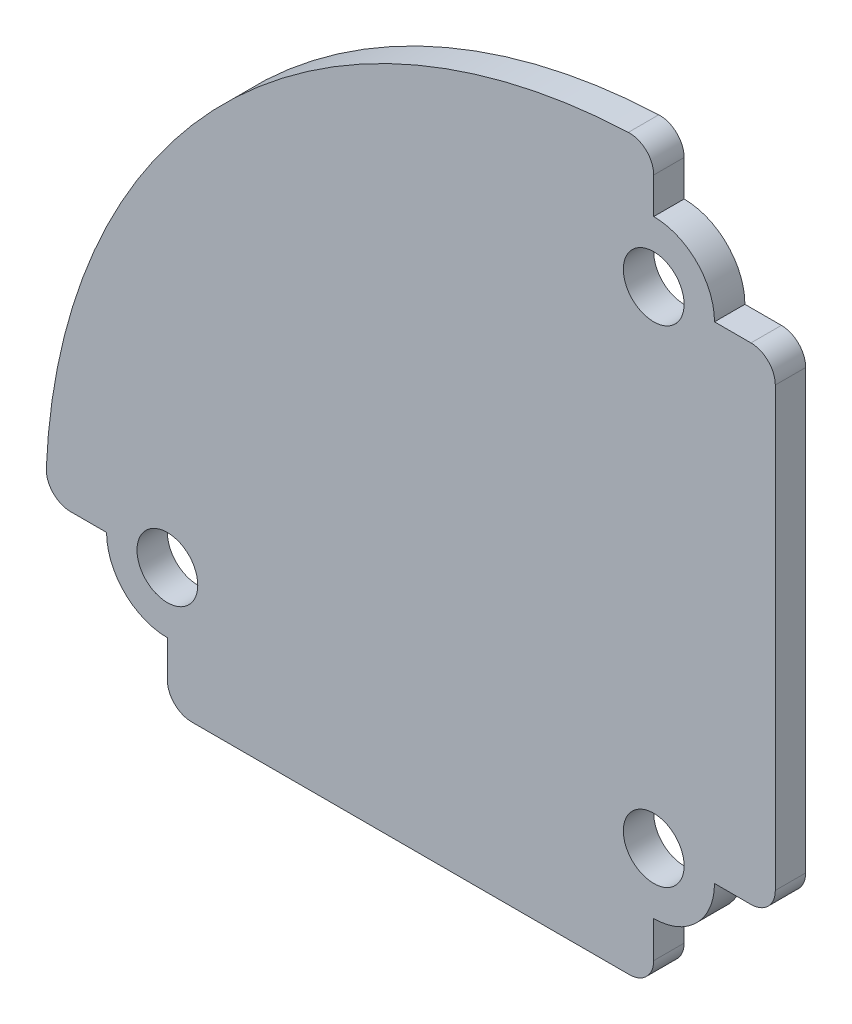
ISO-10303-21;
HEADER;
FILE_DESCRIPTION(('STEP AP214'),'2;1');
FILE_NAME('part.step','',(''),(''),'','','');
FILE_SCHEMA(('AUTOMOTIVE_DESIGN { 1 0 10303 214 1 1 1 1 }'));
ENDSEC;
DATA;
#1=APPLICATION_CONTEXT('core data for automotive mechanical design processes');
#2=APPLICATION_PROTOCOL_DEFINITION('international standard','automotive_design',2000,#1);
#3=PRODUCT_CONTEXT('',#1,'mechanical');
#4=PRODUCT('Part','Part','',(#3));
#5=PRODUCT_RELATED_PRODUCT_CATEGORY('part','',(#4));
#6=PRODUCT_DEFINITION_FORMATION('','',#4);
#7=PRODUCT_DEFINITION_CONTEXT('part definition',#1,'design');
#8=PRODUCT_DEFINITION('design','',#6,#7);
#9=PRODUCT_DEFINITION_SHAPE('','',#8);
#10=(LENGTH_UNIT() NAMED_UNIT(*) SI_UNIT(.MILLI.,.METRE.));
#11=(NAMED_UNIT(*) PLANE_ANGLE_UNIT() SI_UNIT($,.RADIAN.));
#12=(NAMED_UNIT(*) SI_UNIT($,.STERADIAN.) SOLID_ANGLE_UNIT());
#13=UNCERTAINTY_MEASURE_WITH_UNIT(LENGTH_MEASURE(1.E-05),#10,'distance_accuracy_value','');
#14=(GEOMETRIC_REPRESENTATION_CONTEXT(3) GLOBAL_UNCERTAINTY_ASSIGNED_CONTEXT((#13)) GLOBAL_UNIT_ASSIGNED_CONTEXT((#10,
#11,#12)) REPRESENTATION_CONTEXT('',''));
#15=CARTESIAN_POINT('',(0.,0.,0.));
#16=DIRECTION('',(0.,0.,1.));
#17=DIRECTION('',(1.,0.,0.));
#18=AXIS2_PLACEMENT_3D('',#15,#16,#17);
#19=CARTESIAN_POINT('',(-48.26,-10.16,3.175));
#20=DIRECTION('',(0.,0.,1.));
#21=DIRECTION('',(1.,0.,0.));
#22=AXIS2_PLACEMENT_3D('',#19,#20,#21);
#23=PLANE('',#22);
#24=CARTESIAN_POINT('',(0.,0.,3.175));
#25=DIRECTION('',(0.,0.,1.));
#26=DIRECTION('',(1.,0.,0.));
#27=AXIS2_PLACEMENT_3D('',#24,#25,#26);
#28=CIRCLE('',#27,3.175);
#29=CARTESIAN_POINT('',(3.175,0.,3.175));
#30=VERTEX_POINT('',#29);
#31=EDGE_CURVE('E364',#30,#30,#28,.T.);
#32=ORIENTED_EDGE('',*,*,#31,.F.);
#33=EDGE_LOOP('',(#32));
#34=FACE_BOUND('',#33,.T.);
#35=CARTESIAN_POINT('',(-48.26,-10.16,3.175));
#36=DIRECTION('',(0.,0.,1.));
#37=DIRECTION('',(1.,0.,0.));
#38=AXIS2_PLACEMENT_3D('',#35,#36,#37);
#39=CIRCLE('',#38,2.54);
#40=CARTESIAN_POINT('',(-50.8,-10.16,3.175));
#41=VERTEX_POINT('',#40);
#42=CARTESIAN_POINT('',(-48.26,-12.7,3.175));
#43=VERTEX_POINT('',#42);
#44=EDGE_CURVE('E224',#41,#43,#39,.T.);
#45=ORIENTED_EDGE('',*,*,#44,.T.);
#46=DIRECTION('',(1.,0.,0.));
#47=VECTOR('',#46,1.);
#48=CARTESIAN_POINT('',(-48.26,-12.7,3.175));
#49=LINE('',#48,#47);
#50=CARTESIAN_POINT('',(-2.54000000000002,-12.7,3.175));
#51=VERTEX_POINT('',#50);
#52=EDGE_CURVE('E122',#43,#51,#49,.T.);
#53=ORIENTED_EDGE('',*,*,#52,.T.);
#54=CARTESIAN_POINT('',(-2.54,-10.16,3.175));
#55=DIRECTION('',(0.,0.,1.));
#56=DIRECTION('',(1.,0.,0.));
#57=AXIS2_PLACEMENT_3D('',#54,#55,#56);
#58=CIRCLE('',#57,2.54);
#59=CARTESIAN_POINT('',(0.,-10.16,3.175));
#60=VERTEX_POINT('',#59);
#61=EDGE_CURVE('E269',#51,#60,#58,.T.);
#62=ORIENTED_EDGE('',*,*,#61,.T.);
#63=DIRECTION('',(0.,1.,0.));
#64=VECTOR('',#63,1.);
#65=CARTESIAN_POINT('',(0.,-10.16,3.175));
#66=LINE('',#65,#64);
#67=CARTESIAN_POINT('',(0.,-6.35,3.175));
#68=VERTEX_POINT('',#67);
#69=EDGE_CURVE('E288',#60,#68,#66,.T.);
#70=ORIENTED_EDGE('',*,*,#69,.T.);
#71=CARTESIAN_POINT('',(0.,0.,3.175));
#72=DIRECTION('',(0.,0.,1.));
#73=DIRECTION('',(1.,0.,0.));
#74=AXIS2_PLACEMENT_3D('',#71,#72,#73);
#75=CIRCLE('',#74,6.35);
#76=CARTESIAN_POINT('',(6.35,0.,3.175));
#77=VERTEX_POINT('',#76);
#78=EDGE_CURVE('E285',#68,#77,#75,.T.);
#79=ORIENTED_EDGE('',*,*,#78,.T.);
#80=DIRECTION('',(1.,0.,0.));
#81=VECTOR('',#80,1.);
#82=CARTESIAN_POINT('',(6.35,0.,3.175));
#83=LINE('',#82,#81);
#84=CARTESIAN_POINT('',(10.16,0.,3.175));
#85=VERTEX_POINT('',#84);
#86=EDGE_CURVE('E287',#77,#85,#83,.T.);
#87=ORIENTED_EDGE('',*,*,#86,.T.);
#88=CARTESIAN_POINT('',(10.16,2.54,3.175));
#89=DIRECTION('',(0.,0.,1.));
#90=DIRECTION('',(1.,0.,0.));
#91=AXIS2_PLACEMENT_3D('',#88,#89,#90);
#92=CIRCLE('',#91,2.54);
#93=CARTESIAN_POINT('',(12.7,2.54000000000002,3.175));
#94=VERTEX_POINT('',#93);
#95=EDGE_CURVE('E290',#85,#94,#92,.T.);
#96=ORIENTED_EDGE('',*,*,#95,.T.);
#97=DIRECTION('',(0.,1.,0.));
#98=VECTOR('',#97,1.);
#99=CARTESIAN_POINT('',(12.7,2.54000000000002,3.175));
#100=LINE('',#99,#98);
#101=CARTESIAN_POINT('',(12.7,48.26,3.175));
#102=VERTEX_POINT('',#101);
#103=EDGE_CURVE('E296',#94,#102,#100,.T.);
#104=ORIENTED_EDGE('',*,*,#103,.T.);
#105=CARTESIAN_POINT('',(10.16,48.26,3.175));
#106=DIRECTION('',(0.,0.,1.));
#107=DIRECTION('',(1.,0.,0.));
#108=AXIS2_PLACEMENT_3D('',#105,#106,#107);
#109=CIRCLE('',#108,2.54);
#110=CARTESIAN_POINT('',(10.16,50.8,3.175));
#111=VERTEX_POINT('',#110);
#112=EDGE_CURVE('E298',#102,#111,#109,.T.);
#113=ORIENTED_EDGE('',*,*,#112,.T.);
#114=DIRECTION('',(-1.,0.,0.));
#115=VECTOR('',#114,1.);
#116=CARTESIAN_POINT('',(10.16,50.8,3.175));
#117=LINE('',#116,#115);
#118=CARTESIAN_POINT('',(6.35,50.8,3.175));
#119=VERTEX_POINT('',#118);
#120=EDGE_CURVE('E300',#111,#119,#117,.T.);
#121=ORIENTED_EDGE('',*,*,#120,.T.);
#122=CARTESIAN_POINT('',(0.,50.8,3.175));
#123=DIRECTION('',(0.,0.,1.));
#124=DIRECTION('',(1.,0.,0.));
#125=AXIS2_PLACEMENT_3D('',#122,#123,#124);
#126=CIRCLE('',#125,6.35);
#127=CARTESIAN_POINT('',(0.,57.15,3.175));
#128=VERTEX_POINT('',#127);
#129=EDGE_CURVE('E302',#119,#128,#126,.T.);
#130=ORIENTED_EDGE('',*,*,#129,.T.);
#131=DIRECTION('',(0.,1.,0.));
#132=VECTOR('',#131,1.);
#133=CARTESIAN_POINT('',(0.,57.15,3.175));
#134=LINE('',#133,#132);
#135=CARTESIAN_POINT('',(0.,60.9070603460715,3.175));
#136=VERTEX_POINT('',#135);
#137=EDGE_CURVE('E304',#128,#136,#134,.T.);
#138=ORIENTED_EDGE('',*,*,#137,.T.);
#139=CARTESIAN_POINT('',(-2.54,60.9070603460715,3.175));
#140=DIRECTION('',(0.,0.,1.));
#141=DIRECTION('',(1.,0.,0.));
#142=AXIS2_PLACEMENT_3D('',#139,#140,#141);
#143=CIRCLE('',#142,2.54);
#144=CARTESIAN_POINT('',(-2.64583333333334,63.4448545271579,3.175));
#145=VERTEX_POINT('',#144);
#146=EDGE_CURVE('E306',#136,#145,#143,.T.);
#147=ORIENTED_EDGE('',*,*,#146,.T.);
#148=CARTESIAN_POINT('',(0.,0.,3.175));
#149=DIRECTION('',(0.,0.,1.));
#150=DIRECTION('',(1.,0.,0.));
#151=AXIS2_PLACEMENT_3D('',#148,#149,#150);
#152=CIRCLE('',#151,63.5);
#153=CARTESIAN_POINT('',(-63.4448545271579,2.64583333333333,3.175));
#154=VERTEX_POINT('',#153);
#155=EDGE_CURVE('E308',#145,#154,#152,.T.);
#156=ORIENTED_EDGE('',*,*,#155,.T.);
#157=CARTESIAN_POINT('',(-60.9070603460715,2.54,3.175));
#158=DIRECTION('',(0.,0.,1.));
#159=DIRECTION('',(-1.,0.,0.));
#160=AXIS2_PLACEMENT_3D('',#157,#158,#159);
#161=CIRCLE('',#160,2.54);
#162=CARTESIAN_POINT('',(-60.9070603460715,0.,3.175));
#163=VERTEX_POINT('',#162);
#164=EDGE_CURVE('E171',#154,#163,#161,.T.);
#165=ORIENTED_EDGE('',*,*,#164,.T.);
#166=DIRECTION('',(1.,0.,0.));
#167=VECTOR('',#166,1.);
#168=CARTESIAN_POINT('',(-60.9070603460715,0.,3.175));
#169=LINE('',#168,#167);
#170=CARTESIAN_POINT('',(-57.15,0.,3.175));
#171=VERTEX_POINT('',#170);
#172=EDGE_CURVE('E165',#163,#171,#169,.T.);
#173=ORIENTED_EDGE('',*,*,#172,.T.);
#174=CARTESIAN_POINT('',(-50.8,0.,3.175));
#175=DIRECTION('',(0.,0.,1.));
#176=DIRECTION('',(1.,0.,0.));
#177=AXIS2_PLACEMENT_3D('',#174,#175,#176);
#178=CIRCLE('',#177,6.35);
#179=CARTESIAN_POINT('',(-50.8,-6.35,3.175));
#180=VERTEX_POINT('',#179);
#181=EDGE_CURVE('E169',#171,#180,#178,.T.);
#182=ORIENTED_EDGE('',*,*,#181,.T.);
#183=DIRECTION('',(0.,-1.,0.));
#184=VECTOR('',#183,1.);
#185=CARTESIAN_POINT('',(-50.8,-6.35,3.175));
#186=LINE('',#185,#184);
#187=EDGE_CURVE('E49',#180,#41,#186,.T.);
#188=ORIENTED_EDGE('',*,*,#187,.T.);
#189=EDGE_LOOP('',(#45,#53,#62,#70,#79,#87,#96,#104,#113,#121,#130,#138,#147,#156,#165,#173,
#182,#188));
#190=FACE_BOUND('',#189,.T.);
#191=CARTESIAN_POINT('',(0.,50.8,3.175));
#192=DIRECTION('',(0.,0.,1.));
#193=DIRECTION('',(1.,0.,0.));
#194=AXIS2_PLACEMENT_3D('',#191,#192,#193);
#195=CIRCLE('',#194,3.175);
#196=CARTESIAN_POINT('',(3.175,50.8,3.175));
#197=VERTEX_POINT('',#196);
#198=EDGE_CURVE('E193',#197,#197,#195,.T.);
#199=ORIENTED_EDGE('',*,*,#198,.F.);
#200=EDGE_LOOP('',(#199));
#201=FACE_BOUND('',#200,.T.);
#202=CARTESIAN_POINT('',(-50.8,0.,3.175));
#203=DIRECTION('',(0.,0.,1.));
#204=DIRECTION('',(1.,0.,0.));
#205=AXIS2_PLACEMENT_3D('',#202,#203,#204);
#206=CIRCLE('',#205,3.175);
#207=CARTESIAN_POINT('',(-47.625,0.,3.175));
#208=VERTEX_POINT('',#207);
#209=EDGE_CURVE('E355',#208,#208,#206,.T.);
#210=ORIENTED_EDGE('',*,*,#209,.F.);
#211=EDGE_LOOP('',(#210));
#212=FACE_BOUND('',#211,.T.);
#213=ADVANCED_FACE('F32',(#34,#190,#201,#212),#23,.T.);
#214=CARTESIAN_POINT('',(-48.26,-10.16,0.));
#215=DIRECTION('',(0.,0.,1.));
#216=DIRECTION('',(1.,0.,0.));
#217=AXIS2_PLACEMENT_3D('',#214,#215,#216);
#218=PLANE('',#217);
#219=CARTESIAN_POINT('',(0.,0.,0.));
#220=DIRECTION('',(0.,0.,1.));
#221=DIRECTION('',(1.,0.,0.));
#222=AXIS2_PLACEMENT_3D('',#219,#220,#221);
#223=CIRCLE('',#222,3.175);
#224=CARTESIAN_POINT('',(3.175,0.,0.));
#225=VERTEX_POINT('',#224);
#226=EDGE_CURVE('E361',#225,#225,#223,.T.);
#227=ORIENTED_EDGE('',*,*,#226,.T.);
#228=EDGE_LOOP('',(#227));
#229=FACE_BOUND('',#228,.T.);
#230=CARTESIAN_POINT('',(-48.26,-10.16,0.));
#231=DIRECTION('',(0.,0.,1.));
#232=DIRECTION('',(1.,0.,0.));
#233=AXIS2_PLACEMENT_3D('',#230,#231,#232);
#234=CIRCLE('',#233,2.54);
#235=CARTESIAN_POINT('',(-50.8,-10.16,0.));
#236=VERTEX_POINT('',#235);
#237=CARTESIAN_POINT('',(-48.26,-12.7,0.));
#238=VERTEX_POINT('',#237);
#239=EDGE_CURVE('E189',#236,#238,#234,.T.);
#240=ORIENTED_EDGE('',*,*,#239,.F.);
#241=DIRECTION('',(0.,-1.,0.));
#242=VECTOR('',#241,1.);
#243=CARTESIAN_POINT('',(-50.8,-6.35,0.));
#244=LINE('',#243,#242);
#245=CARTESIAN_POINT('',(-50.8,-6.35,0.));
#246=VERTEX_POINT('',#245);
#247=EDGE_CURVE('E114',#246,#236,#244,.T.);
#248=ORIENTED_EDGE('',*,*,#247,.F.);
#249=CARTESIAN_POINT('',(-50.8,0.,0.));
#250=DIRECTION('',(0.,0.,1.));
#251=DIRECTION('',(1.,0.,0.));
#252=AXIS2_PLACEMENT_3D('',#249,#250,#251);
#253=CIRCLE('',#252,6.35);
#254=CARTESIAN_POINT('',(-57.15,0.,0.));
#255=VERTEX_POINT('',#254);
#256=EDGE_CURVE('E108',#255,#246,#253,.T.);
#257=ORIENTED_EDGE('',*,*,#256,.F.);
#258=DIRECTION('',(1.,0.,0.));
#259=VECTOR('',#258,1.);
#260=CARTESIAN_POINT('',(-60.9070603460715,0.,0.));
#261=LINE('',#260,#259);
#262=CARTESIAN_POINT('',(-60.9070603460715,0.,0.));
#263=VERTEX_POINT('',#262);
#264=EDGE_CURVE('E179',#263,#255,#261,.T.);
#265=ORIENTED_EDGE('',*,*,#264,.F.);
#266=CARTESIAN_POINT('',(-60.9070603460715,2.54,0.));
#267=DIRECTION('',(0.,0.,1.));
#268=DIRECTION('',(-1.,0.,0.));
#269=AXIS2_PLACEMENT_3D('',#266,#267,#268);
#270=CIRCLE('',#269,2.54);
#271=CARTESIAN_POINT('',(-63.4448545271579,2.64583333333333,0.));
#272=VERTEX_POINT('',#271);
#273=EDGE_CURVE('E219',#272,#263,#270,.T.);
#274=ORIENTED_EDGE('',*,*,#273,.F.);
#275=CARTESIAN_POINT('',(0.,0.,0.));
#276=DIRECTION('',(0.,0.,1.));
#277=DIRECTION('',(1.,0.,0.));
#278=AXIS2_PLACEMENT_3D('',#275,#276,#277);
#279=CIRCLE('',#278,63.5);
#280=CARTESIAN_POINT('',(-2.64583333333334,63.4448545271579,0.));
#281=VERTEX_POINT('',#280);
#282=EDGE_CURVE('E217',#281,#272,#279,.T.);
#283=ORIENTED_EDGE('',*,*,#282,.F.);
#284=CARTESIAN_POINT('',(-2.54,60.9070603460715,0.));
#285=DIRECTION('',(0.,0.,1.));
#286=DIRECTION('',(1.,0.,0.));
#287=AXIS2_PLACEMENT_3D('',#284,#285,#286);
#288=CIRCLE('',#287,2.54);
#289=CARTESIAN_POINT('',(0.,60.9070603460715,0.));
#290=VERTEX_POINT('',#289);
#291=EDGE_CURVE('E215',#290,#281,#288,.T.);
#292=ORIENTED_EDGE('',*,*,#291,.F.);
#293=DIRECTION('',(0.,1.,0.));
#294=VECTOR('',#293,1.);
#295=CARTESIAN_POINT('',(0.,57.15,0.));
#296=LINE('',#295,#294);
#297=CARTESIAN_POINT('',(0.,57.15,0.));
#298=VERTEX_POINT('',#297);
#299=EDGE_CURVE('E213',#298,#290,#296,.T.);
#300=ORIENTED_EDGE('',*,*,#299,.F.);
#301=CARTESIAN_POINT('',(0.,50.8,0.));
#302=DIRECTION('',(0.,0.,1.));
#303=DIRECTION('',(1.,0.,0.));
#304=AXIS2_PLACEMENT_3D('',#301,#302,#303);
#305=CIRCLE('',#304,6.35);
#306=CARTESIAN_POINT('',(6.35,50.8,0.));
#307=VERTEX_POINT('',#306);
#308=EDGE_CURVE('E211',#307,#298,#305,.T.);
#309=ORIENTED_EDGE('',*,*,#308,.F.);
#310=DIRECTION('',(-1.,0.,0.));
#311=VECTOR('',#310,1.);
#312=CARTESIAN_POINT('',(10.16,50.8,0.));
#313=LINE('',#312,#311);
#314=CARTESIAN_POINT('',(10.16,50.8,0.));
#315=VERTEX_POINT('',#314);
#316=EDGE_CURVE('E209',#315,#307,#313,.T.);
#317=ORIENTED_EDGE('',*,*,#316,.F.);
#318=CARTESIAN_POINT('',(10.16,48.26,0.));
#319=DIRECTION('',(0.,0.,1.));
#320=DIRECTION('',(1.,0.,0.));
#321=AXIS2_PLACEMENT_3D('',#318,#319,#320);
#322=CIRCLE('',#321,2.54);
#323=CARTESIAN_POINT('',(12.7,48.26,0.));
#324=VERTEX_POINT('',#323);
#325=EDGE_CURVE('E207',#324,#315,#322,.T.);
#326=ORIENTED_EDGE('',*,*,#325,.F.);
#327=DIRECTION('',(0.,1.,0.));
#328=VECTOR('',#327,1.);
#329=CARTESIAN_POINT('',(12.7,2.54000000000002,0.));
#330=LINE('',#329,#328);
#331=CARTESIAN_POINT('',(12.7,2.54000000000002,0.));
#332=VERTEX_POINT('',#331);
#333=EDGE_CURVE('E205',#332,#324,#330,.T.);
#334=ORIENTED_EDGE('',*,*,#333,.F.);
#335=CARTESIAN_POINT('',(10.16,2.54,0.));
#336=DIRECTION('',(0.,0.,1.));
#337=DIRECTION('',(1.,0.,0.));
#338=AXIS2_PLACEMENT_3D('',#335,#336,#337);
#339=CIRCLE('',#338,2.54);
#340=CARTESIAN_POINT('',(10.16,0.,0.));
#341=VERTEX_POINT('',#340);
#342=EDGE_CURVE('E203',#341,#332,#339,.T.);
#343=ORIENTED_EDGE('',*,*,#342,.F.);
#344=DIRECTION('',(1.,0.,0.));
#345=VECTOR('',#344,1.);
#346=CARTESIAN_POINT('',(6.35,0.,0.));
#347=LINE('',#346,#345);
#348=CARTESIAN_POINT('',(6.35,0.,0.));
#349=VERTEX_POINT('',#348);
#350=EDGE_CURVE('E201',#349,#341,#347,.T.);
#351=ORIENTED_EDGE('',*,*,#350,.F.);
#352=CARTESIAN_POINT('',(0.,0.,0.));
#353=DIRECTION('',(0.,0.,1.));
#354=DIRECTION('',(1.,0.,0.));
#355=AXIS2_PLACEMENT_3D('',#352,#353,#354);
#356=CIRCLE('',#355,6.35);
#357=CARTESIAN_POINT('',(0.,-6.35,0.));
#358=VERTEX_POINT('',#357);
#359=EDGE_CURVE('E199',#358,#349,#356,.T.);
#360=ORIENTED_EDGE('',*,*,#359,.F.);
#361=DIRECTION('',(0.,1.,0.));
#362=VECTOR('',#361,1.);
#363=CARTESIAN_POINT('',(0.,-10.16,0.));
#364=LINE('',#363,#362);
#365=CARTESIAN_POINT('',(0.,-10.16,0.));
#366=VERTEX_POINT('',#365);
#367=EDGE_CURVE('E197',#366,#358,#364,.T.);
#368=ORIENTED_EDGE('',*,*,#367,.F.);
#369=CARTESIAN_POINT('',(-2.54,-10.16,0.));
#370=DIRECTION('',(0.,0.,1.));
#371=DIRECTION('',(1.,0.,0.));
#372=AXIS2_PLACEMENT_3D('',#369,#370,#371);
#373=CIRCLE('',#372,2.54);
#374=CARTESIAN_POINT('',(-2.54000000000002,-12.7,0.));
#375=VERTEX_POINT('',#374);
#376=EDGE_CURVE('E195',#375,#366,#373,.T.);
#377=ORIENTED_EDGE('',*,*,#376,.F.);
#378=DIRECTION('',(1.,0.,0.));
#379=VECTOR('',#378,1.);
#380=CARTESIAN_POINT('',(-48.26,-12.7,0.));
#381=LINE('',#380,#379);
#382=EDGE_CURVE('E192',#238,#375,#381,.T.);
#383=ORIENTED_EDGE('',*,*,#382,.F.);
#384=EDGE_LOOP('',(#240,#248,#257,#265,#274,#283,#292,#300,#309,#317,#326,#334,#343,#351,#360,
#368,#377,#383));
#385=FACE_BOUND('',#384,.T.);
#386=CARTESIAN_POINT('',(0.,50.8,0.));
#387=DIRECTION('',(0.,0.,1.));
#388=DIRECTION('',(1.,0.,0.));
#389=AXIS2_PLACEMENT_3D('',#386,#387,#388);
#390=CIRCLE('',#389,3.175);
#391=CARTESIAN_POINT('',(3.175,50.8,0.));
#392=VERTEX_POINT('',#391);
#393=EDGE_CURVE('E367',#392,#392,#390,.T.);
#394=ORIENTED_EDGE('',*,*,#393,.T.);
#395=EDGE_LOOP('',(#394));
#396=FACE_BOUND('',#395,.T.);
#397=CARTESIAN_POINT('',(-50.8,0.,0.));
#398=DIRECTION('',(0.,0.,1.));
#399=DIRECTION('',(1.,0.,0.));
#400=AXIS2_PLACEMENT_3D('',#397,#398,#399);
#401=CIRCLE('',#400,3.175);
#402=CARTESIAN_POINT('',(-47.625,0.,0.));
#403=VERTEX_POINT('',#402);
#404=EDGE_CURVE('E358',#403,#403,#401,.T.);
#405=ORIENTED_EDGE('',*,*,#404,.T.);
#406=EDGE_LOOP('',(#405));
#407=FACE_BOUND('',#406,.T.);
#408=ADVANCED_FACE('F273',(#229,#385,#396,#407),#218,.F.);
#409=CARTESIAN_POINT('',(-48.26,-10.16,3.175));
#410=DIRECTION('',(0.,0.,-1.));
#411=DIRECTION('',(-1.,0.,0.));
#412=AXIS2_PLACEMENT_3D('',#409,#410,#411);
#413=CYLINDRICAL_SURFACE('',#412,2.54);
#414=ORIENTED_EDGE('',*,*,#239,.T.);
#415=DIRECTION('',(0.,0.,-1.));
#416=VECTOR('',#415,1.);
#417=CARTESIAN_POINT('',(-48.26,-12.7,3.175));
#418=LINE('',#417,#416);
#419=EDGE_CURVE('E11',#43,#238,#418,.T.);
#420=ORIENTED_EDGE('',*,*,#419,.F.);
#421=ORIENTED_EDGE('',*,*,#44,.F.);
#422=DIRECTION('',(0.,0.,-1.));
#423=VECTOR('',#422,1.);
#424=CARTESIAN_POINT('',(-50.8,-10.16,3.175));
#425=LINE('',#424,#423);
#426=EDGE_CURVE('E185',#41,#236,#425,.T.);
#427=ORIENTED_EDGE('',*,*,#426,.T.);
#428=EDGE_LOOP('',(#414,#420,#421,#427));
#429=FACE_BOUND('',#428,.T.);
#430=ADVANCED_FACE('F34',(#429),#413,.T.);
#431=CARTESIAN_POINT('',(-48.26,-12.7,3.175));
#432=DIRECTION('',(0.,1.,0.));
#433=DIRECTION('',(-1.,0.,0.));
#434=AXIS2_PLACEMENT_3D('',#431,#432,#433);
#435=PLANE('',#434);
#436=ORIENTED_EDGE('',*,*,#382,.T.);
#437=DIRECTION('',(0.,0.,-1.));
#438=VECTOR('',#437,1.);
#439=CARTESIAN_POINT('',(-2.54000000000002,-12.7,3.175));
#440=LINE('',#439,#438);
#441=EDGE_CURVE('E41',#51,#375,#440,.T.);
#442=ORIENTED_EDGE('',*,*,#441,.F.);
#443=ORIENTED_EDGE('',*,*,#52,.F.);
#444=ORIENTED_EDGE('',*,*,#419,.T.);
#445=EDGE_LOOP('',(#436,#442,#443,#444));
#446=FACE_BOUND('',#445,.T.);
#447=ADVANCED_FACE('F528',(#446),#435,.F.);
#448=CARTESIAN_POINT('',(-2.54,-10.16,3.175));
#449=DIRECTION('',(0.,0.,-1.));
#450=DIRECTION('',(-1.,0.,0.));
#451=AXIS2_PLACEMENT_3D('',#448,#449,#450);
#452=CYLINDRICAL_SURFACE('',#451,2.54);
#453=ORIENTED_EDGE('',*,*,#376,.T.);
#454=DIRECTION('',(0.,0.,-1.));
#455=VECTOR('',#454,1.);
#456=CARTESIAN_POINT('',(0.,-10.16,3.175));
#457=LINE('',#456,#455);
#458=EDGE_CURVE('E261',#60,#366,#457,.T.);
#459=ORIENTED_EDGE('',*,*,#458,.F.);
#460=ORIENTED_EDGE('',*,*,#61,.F.);
#461=ORIENTED_EDGE('',*,*,#441,.T.);
#462=EDGE_LOOP('',(#453,#459,#460,#461));
#463=FACE_BOUND('',#462,.T.);
#464=ADVANCED_FACE('F267',(#463),#452,.T.);
#465=CARTESIAN_POINT('',(0.,-10.16,3.175));
#466=DIRECTION('',(-1.,0.,0.));
#467=DIRECTION('',(0.,-1.,0.));
#468=AXIS2_PLACEMENT_3D('',#465,#466,#467);
#469=PLANE('',#468);
#470=ORIENTED_EDGE('',*,*,#367,.T.);
#471=DIRECTION('',(0.,0.,-1.));
#472=VECTOR('',#471,1.);
#473=CARTESIAN_POINT('',(0.,-6.35,3.175));
#474=LINE('',#473,#472);
#475=EDGE_CURVE('E258',#68,#358,#474,.T.);
#476=ORIENTED_EDGE('',*,*,#475,.F.);
#477=ORIENTED_EDGE('',*,*,#69,.F.);
#478=ORIENTED_EDGE('',*,*,#458,.T.);
#479=EDGE_LOOP('',(#470,#476,#477,#478));
#480=FACE_BOUND('',#479,.T.);
#481=ADVANCED_FACE('F279',(#480),#469,.F.);
#482=CARTESIAN_POINT('',(0.,0.,3.175));
#483=DIRECTION('',(0.,0.,-1.));
#484=DIRECTION('',(-1.,0.,0.));
#485=AXIS2_PLACEMENT_3D('',#482,#483,#484);
#486=CYLINDRICAL_SURFACE('',#485,6.35);
#487=ORIENTED_EDGE('',*,*,#359,.T.);
#488=DIRECTION('',(0.,0.,-1.));
#489=VECTOR('',#488,1.);
#490=CARTESIAN_POINT('',(6.35,0.,3.175));
#491=LINE('',#490,#489);
#492=EDGE_CURVE('E255',#77,#349,#491,.T.);
#493=ORIENTED_EDGE('',*,*,#492,.F.);
#494=ORIENTED_EDGE('',*,*,#78,.F.);
#495=ORIENTED_EDGE('',*,*,#475,.T.);
#496=EDGE_LOOP('',(#487,#493,#494,#495));
#497=FACE_BOUND('',#496,.T.);
#498=ADVANCED_FACE('F283',(#497),#486,.T.);
#499=CARTESIAN_POINT('',(6.35,0.,3.175));
#500=DIRECTION('',(0.,1.,0.));
#501=DIRECTION('',(0.,0.,1.));
#502=AXIS2_PLACEMENT_3D('',#499,#500,#501);
#503=PLANE('',#502);
#504=ORIENTED_EDGE('',*,*,#350,.T.);
#505=DIRECTION('',(0.,0.,-1.));
#506=VECTOR('',#505,1.);
#507=CARTESIAN_POINT('',(10.16,0.,3.175));
#508=LINE('',#507,#506);
#509=EDGE_CURVE('E252',#85,#341,#508,.T.);
#510=ORIENTED_EDGE('',*,*,#509,.F.);
#511=ORIENTED_EDGE('',*,*,#86,.F.);
#512=ORIENTED_EDGE('',*,*,#492,.T.);
#513=EDGE_LOOP('',(#504,#510,#511,#512));
#514=FACE_BOUND('',#513,.T.);
#515=ADVANCED_FACE('F493',(#514),#503,.F.);
#516=CARTESIAN_POINT('',(10.16,2.54,3.175));
#517=DIRECTION('',(0.,0.,-1.));
#518=DIRECTION('',(-1.,0.,0.));
#519=AXIS2_PLACEMENT_3D('',#516,#517,#518);
#520=CYLINDRICAL_SURFACE('',#519,2.54);
#521=ORIENTED_EDGE('',*,*,#342,.T.);
#522=DIRECTION('',(0.,0.,-1.));
#523=VECTOR('',#522,1.);
#524=CARTESIAN_POINT('',(12.7,2.54000000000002,3.175));
#525=LINE('',#524,#523);
#526=EDGE_CURVE('E249',#94,#332,#525,.T.);
#527=ORIENTED_EDGE('',*,*,#526,.F.);
#528=ORIENTED_EDGE('',*,*,#95,.F.);
#529=ORIENTED_EDGE('',*,*,#509,.T.);
#530=EDGE_LOOP('',(#521,#527,#528,#529));
#531=FACE_BOUND('',#530,.T.);
#532=ADVANCED_FACE('F483',(#531),#520,.T.);
#533=CARTESIAN_POINT('',(12.7,2.54000000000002,3.175));
#534=DIRECTION('',(-1.,0.,0.));
#535=DIRECTION('',(0.,0.,1.));
#536=AXIS2_PLACEMENT_3D('',#533,#534,#535);
#537=PLANE('',#536);
#538=ORIENTED_EDGE('',*,*,#333,.T.);
#539=DIRECTION('',(0.,0.,-1.));
#540=VECTOR('',#539,1.);
#541=CARTESIAN_POINT('',(12.7,48.26,3.175));
#542=LINE('',#541,#540);
#543=EDGE_CURVE('E246',#102,#324,#542,.T.);
#544=ORIENTED_EDGE('',*,*,#543,.F.);
#545=ORIENTED_EDGE('',*,*,#103,.F.);
#546=ORIENTED_EDGE('',*,*,#526,.T.);
#547=EDGE_LOOP('',(#538,#544,#545,#546));
#548=FACE_BOUND('',#547,.T.);
#549=ADVANCED_FACE('F473',(#548),#537,.F.);
#550=CARTESIAN_POINT('',(10.16,48.26,3.175));
#551=DIRECTION('',(0.,0.,-1.));
#552=DIRECTION('',(-1.,0.,0.));
#553=AXIS2_PLACEMENT_3D('',#550,#551,#552);
#554=CYLINDRICAL_SURFACE('',#553,2.54);
#555=ORIENTED_EDGE('',*,*,#325,.T.);
#556=DIRECTION('',(0.,0.,-1.));
#557=VECTOR('',#556,1.);
#558=CARTESIAN_POINT('',(10.16,50.8,3.175));
#559=LINE('',#558,#557);
#560=EDGE_CURVE('E243',#111,#315,#559,.T.);
#561=ORIENTED_EDGE('',*,*,#560,.F.);
#562=ORIENTED_EDGE('',*,*,#112,.F.);
#563=ORIENTED_EDGE('',*,*,#543,.T.);
#564=EDGE_LOOP('',(#555,#561,#562,#563));
#565=FACE_BOUND('',#564,.T.);
#566=ADVANCED_FACE('F463',(#565),#554,.T.);
#567=CARTESIAN_POINT('',(10.16,50.8,3.175));
#568=DIRECTION('',(0.,-1.,0.));
#569=DIRECTION('',(0.,0.,-1.));
#570=AXIS2_PLACEMENT_3D('',#567,#568,#569);
#571=PLANE('',#570);
#572=ORIENTED_EDGE('',*,*,#316,.T.);
#573=DIRECTION('',(0.,0.,-1.));
#574=VECTOR('',#573,1.);
#575=CARTESIAN_POINT('',(6.35,50.8,3.175));
#576=LINE('',#575,#574);
#577=EDGE_CURVE('E240',#119,#307,#576,.T.);
#578=ORIENTED_EDGE('',*,*,#577,.F.);
#579=ORIENTED_EDGE('',*,*,#120,.F.);
#580=ORIENTED_EDGE('',*,*,#560,.T.);
#581=EDGE_LOOP('',(#572,#578,#579,#580));
#582=FACE_BOUND('',#581,.T.);
#583=ADVANCED_FACE('F453',(#582),#571,.F.);
#584=CARTESIAN_POINT('',(0.,50.8,3.175));
#585=DIRECTION('',(0.,0.,-1.));
#586=DIRECTION('',(-1.,0.,0.));
#587=AXIS2_PLACEMENT_3D('',#584,#585,#586);
#588=CYLINDRICAL_SURFACE('',#587,6.35);
#589=ORIENTED_EDGE('',*,*,#308,.T.);
#590=DIRECTION('',(0.,0.,-1.));
#591=VECTOR('',#590,1.);
#592=CARTESIAN_POINT('',(0.,57.15,3.175));
#593=LINE('',#592,#591);
#594=EDGE_CURVE('E237',#128,#298,#593,.T.);
#595=ORIENTED_EDGE('',*,*,#594,.F.);
#596=ORIENTED_EDGE('',*,*,#129,.F.);
#597=ORIENTED_EDGE('',*,*,#577,.T.);
#598=EDGE_LOOP('',(#589,#595,#596,#597));
#599=FACE_BOUND('',#598,.T.);
#600=ADVANCED_FACE('F443',(#599),#588,.T.);
#601=CARTESIAN_POINT('',(0.,57.15,3.175));
#602=DIRECTION('',(-1.,0.,0.));
#603=DIRECTION('',(0.,-1.,0.));
#604=AXIS2_PLACEMENT_3D('',#601,#602,#603);
#605=PLANE('',#604);
#606=ORIENTED_EDGE('',*,*,#299,.T.);
#607=DIRECTION('',(0.,0.,-1.));
#608=VECTOR('',#607,1.);
#609=CARTESIAN_POINT('',(0.,60.9070603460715,3.175));
#610=LINE('',#609,#608);
#611=EDGE_CURVE('E234',#136,#290,#610,.T.);
#612=ORIENTED_EDGE('',*,*,#611,.F.);
#613=ORIENTED_EDGE('',*,*,#137,.F.);
#614=ORIENTED_EDGE('',*,*,#594,.T.);
#615=EDGE_LOOP('',(#606,#612,#613,#614));
#616=FACE_BOUND('',#615,.T.);
#617=ADVANCED_FACE('F433',(#616),#605,.F.);
#618=CARTESIAN_POINT('',(-2.54,60.9070603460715,3.175));
#619=DIRECTION('',(0.,0.,-1.));
#620=DIRECTION('',(-1.,0.,0.));
#621=AXIS2_PLACEMENT_3D('',#618,#619,#620);
#622=CYLINDRICAL_SURFACE('',#621,2.54);
#623=ORIENTED_EDGE('',*,*,#291,.T.);
#624=DIRECTION('',(0.,0.,-1.));
#625=VECTOR('',#624,1.);
#626=CARTESIAN_POINT('',(-2.64583333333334,63.4448545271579,3.175));
#627=LINE('',#626,#625);
#628=EDGE_CURVE('E231',#145,#281,#627,.T.);
#629=ORIENTED_EDGE('',*,*,#628,.F.);
#630=ORIENTED_EDGE('',*,*,#146,.F.);
#631=ORIENTED_EDGE('',*,*,#611,.T.);
#632=EDGE_LOOP('',(#623,#629,#630,#631));
#633=FACE_BOUND('',#632,.T.);
#634=ADVANCED_FACE('F424',(#633),#622,.T.);
#635=CARTESIAN_POINT('',(0.,0.,3.175));
#636=DIRECTION('',(0.,0.,-1.));
#637=DIRECTION('',(-1.,0.,0.));
#638=AXIS2_PLACEMENT_3D('',#635,#636,#637);
#639=CYLINDRICAL_SURFACE('',#638,63.5);
#640=ORIENTED_EDGE('',*,*,#282,.T.);
#641=DIRECTION('',(0.,0.,-1.));
#642=VECTOR('',#641,1.);
#643=CARTESIAN_POINT('',(-63.4448545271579,2.64583333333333,3.175));
#644=LINE('',#643,#642);
#645=EDGE_CURVE('E228',#154,#272,#644,.T.);
#646=ORIENTED_EDGE('',*,*,#645,.F.);
#647=ORIENTED_EDGE('',*,*,#155,.F.);
#648=ORIENTED_EDGE('',*,*,#628,.T.);
#649=EDGE_LOOP('',(#640,#646,#647,#648));
#650=FACE_BOUND('',#649,.T.);
#651=ADVANCED_FACE('F314',(#650),#639,.T.);
#652=CARTESIAN_POINT('',(-60.9070603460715,2.54,3.175));
#653=DIRECTION('',(0.,0.,-1.));
#654=DIRECTION('',(-1.,0.,0.));
#655=AXIS2_PLACEMENT_3D('',#652,#653,#654);
#656=CYLINDRICAL_SURFACE('',#655,2.54);
#657=ORIENTED_EDGE('',*,*,#273,.T.);
#658=DIRECTION('',(0.,0.,-1.));
#659=VECTOR('',#658,1.);
#660=CARTESIAN_POINT('',(-60.9070603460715,0.,3.175));
#661=LINE('',#660,#659);
#662=EDGE_CURVE('E180',#163,#263,#661,.T.);
#663=ORIENTED_EDGE('',*,*,#662,.F.);
#664=ORIENTED_EDGE('',*,*,#164,.F.);
#665=ORIENTED_EDGE('',*,*,#645,.T.);
#666=EDGE_LOOP('',(#657,#663,#664,#665));
#667=FACE_BOUND('',#666,.T.);
#668=ADVANCED_FACE('F318',(#667),#656,.T.);
#669=CARTESIAN_POINT('',(-60.9070603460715,0.,3.175));
#670=DIRECTION('',(0.,1.,0.));
#671=DIRECTION('',(0.,0.,1.));
#672=AXIS2_PLACEMENT_3D('',#669,#670,#671);
#673=PLANE('',#672);
#674=ORIENTED_EDGE('',*,*,#264,.T.);
#675=DIRECTION('',(0.,0.,-1.));
#676=VECTOR('',#675,1.);
#677=CARTESIAN_POINT('',(-57.15,0.,3.175));
#678=LINE('',#677,#676);
#679=EDGE_CURVE('E176',#171,#255,#678,.T.);
#680=ORIENTED_EDGE('',*,*,#679,.F.);
#681=ORIENTED_EDGE('',*,*,#172,.F.);
#682=ORIENTED_EDGE('',*,*,#662,.T.);
#683=EDGE_LOOP('',(#674,#680,#681,#682));
#684=FACE_BOUND('',#683,.T.);
#685=ADVANCED_FACE('F177',(#684),#673,.F.);
#686=CARTESIAN_POINT('',(-50.8,0.,3.175));
#687=DIRECTION('',(0.,0.,-1.));
#688=DIRECTION('',(-1.,0.,0.));
#689=AXIS2_PLACEMENT_3D('',#686,#687,#688);
#690=CYLINDRICAL_SURFACE('',#689,6.35);
#691=ORIENTED_EDGE('',*,*,#256,.T.);
#692=DIRECTION('',(0.,0.,-1.));
#693=VECTOR('',#692,1.);
#694=CARTESIAN_POINT('',(-50.8,-6.35,3.175));
#695=LINE('',#694,#693);
#696=EDGE_CURVE('E181',#180,#246,#695,.T.);
#697=ORIENTED_EDGE('',*,*,#696,.F.);
#698=ORIENTED_EDGE('',*,*,#181,.F.);
#699=ORIENTED_EDGE('',*,*,#679,.T.);
#700=EDGE_LOOP('',(#691,#697,#698,#699));
#701=FACE_BOUND('',#700,.T.);
#702=ADVANCED_FACE('F183',(#701),#690,.T.);
#703=CARTESIAN_POINT('',(-50.8,-6.35,3.175));
#704=DIRECTION('',(1.,0.,0.));
#705=DIRECTION('',(0.,0.,-1.));
#706=AXIS2_PLACEMENT_3D('',#703,#704,#705);
#707=PLANE('',#706);
#708=ORIENTED_EDGE('',*,*,#247,.T.);
#709=ORIENTED_EDGE('',*,*,#426,.F.);
#710=ORIENTED_EDGE('',*,*,#187,.F.);
#711=ORIENTED_EDGE('',*,*,#696,.T.);
#712=EDGE_LOOP('',(#708,#709,#710,#711));
#713=FACE_BOUND('',#712,.T.);
#714=ADVANCED_FACE('F322',(#713),#707,.F.);
#715=CARTESIAN_POINT('',(0.,50.8,3.175));
#716=DIRECTION('',(0.,0.,-1.));
#717=DIRECTION('',(-1.,0.,0.));
#718=AXIS2_PLACEMENT_3D('',#715,#716,#717);
#719=CYLINDRICAL_SURFACE('',#718,3.175);
#720=ORIENTED_EDGE('',*,*,#198,.T.);
#721=EDGE_LOOP('',(#720));
#722=FACE_BOUND('',#721,.T.);
#723=ORIENTED_EDGE('',*,*,#393,.F.);
#724=EDGE_LOOP('',(#723));
#725=FACE_BOUND('',#724,.T.);
#726=ADVANCED_FACE('F324',(#722,#725),#719,.F.);
#727=CARTESIAN_POINT('',(0.,0.,3.175));
#728=DIRECTION('',(0.,0.,-1.));
#729=DIRECTION('',(-1.,0.,0.));
#730=AXIS2_PLACEMENT_3D('',#727,#728,#729);
#731=CYLINDRICAL_SURFACE('',#730,3.175);
#732=ORIENTED_EDGE('',*,*,#31,.T.);
#733=EDGE_LOOP('',(#732));
#734=FACE_BOUND('',#733,.T.);
#735=ORIENTED_EDGE('',*,*,#226,.F.);
#736=EDGE_LOOP('',(#735));
#737=FACE_BOUND('',#736,.T.);
#738=ADVANCED_FACE('F330',(#734,#737),#731,.F.);
#739=CARTESIAN_POINT('',(-50.8,0.,3.175));
#740=DIRECTION('',(0.,0.,-1.));
#741=DIRECTION('',(-1.,0.,0.));
#742=AXIS2_PLACEMENT_3D('',#739,#740,#741);
#743=CYLINDRICAL_SURFACE('',#742,3.175);
#744=ORIENTED_EDGE('',*,*,#209,.T.);
#745=EDGE_LOOP('',(#744));
#746=FACE_BOUND('',#745,.T.);
#747=ORIENTED_EDGE('',*,*,#404,.F.);
#748=EDGE_LOOP('',(#747));
#749=FACE_BOUND('',#748,.T.);
#750=ADVANCED_FACE('F346',(#746,#749),#743,.F.);
#751=CLOSED_SHELL('',(#213,#408,#430,#447,#464,#481,#498,#515,#532,#549,#566,#583,#600,#617,
#634,#651,#668,#685,#702,#714,#726,#738,#750));
#752=MANIFOLD_SOLID_BREP('B2',#751);
#753=ADVANCED_BREP_SHAPE_REPRESENTATION('',(#18,#752),#14);
#754=SHAPE_DEFINITION_REPRESENTATION(#9,#753);
ENDSEC;
END-ISO-10303-21;
